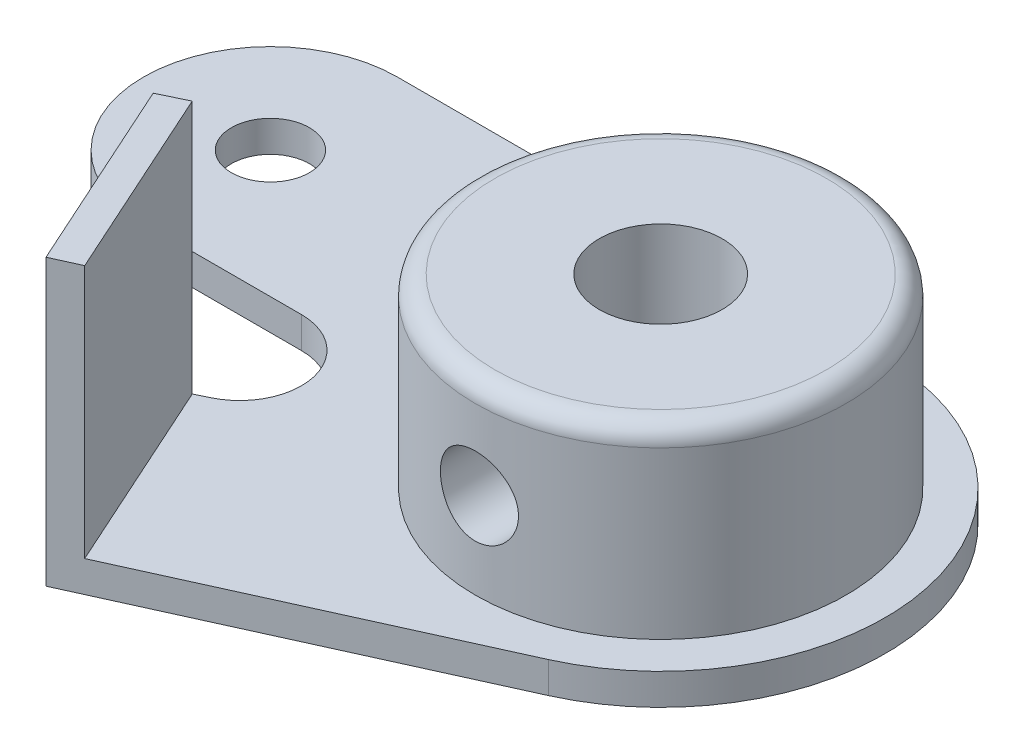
from build123d import *

# Parameters (mm, degrees)
ESQUISSE1_R             = 3.15
ESQUISSE1_R_2           = 2
BOSS_EXTRU_1_DEPTH      = 1.6
ESQUISSE2_R             = 9.5
ESQUISSE2_R_2           = 3.15
BOSS_EXTRU_2_DEPTH      = 9.5
CONG_1_R                = 1
BOSS_EXTRU_3_DEPTH      = 13
ESQUISSE4_R             = 2
ENL_V_MAT_EXTRU_1_DEPTH = 40.340310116


with BuildPart() as part:
    # Esquisse1 → Boss.-Extru.1 (new body)
    with BuildSketch(Plane(origin=(0, 0, 0), x_dir=(1, 0, 0), z_dir=(0, 1, 0))):
        with BuildLine():
            Line((0, 11.5), (-25, 11.5))
            ThreePointArc((-25, 11.5), (-31.5, 5), (-25, -1.5))
            Line((-25, -1.5), (-16.90921754, -1.5))
            ThreePointArc((-16.90921754, -1.5), (-13.826301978, -3.956560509), (-15.532463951, -7.510159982))
            Line((-15.532463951, -7.510159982), (-17.532463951, -8.477187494))
            Line((-17.532463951, -8.477187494), (-13, -18.5))
            Line((-13, -18.5), (4.73848504, -10.478394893))
            ThreePointArc((4.73848504, -10.478394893), (11.241697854, 2.423680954), (0, 11.5))
        make_face()
        with Locations(Location((0, 0, 0), (0, 0, 270))):
            Circle(ESQUISSE1_R, mode=Mode.SUBTRACT)
        with Locations(Location((-25, 5, 0), (0, 0, 270))):
            Circle(ESQUISSE1_R_2, mode=Mode.SUBTRACT)
    extrude(amount=BOSS_EXTRU_1_DEPTH)

    # Esquisse2 → Boss.-Extru.2 (add)
    with BuildSketch(Plane(origin=(0, 1.6, 0), x_dir=(1, 0, 0), z_dir=(0, 1, 0))):
        with Locations(Location((0, 0, 0), (0, 0, 270))):
            Circle(ESQUISSE2_R)
        with Locations(Location((0, 0, 0), (0, 0, 270))):
            Circle(ESQUISSE2_R_2, mode=Mode.SUBTRACT)
    extrude(amount=BOSS_EXTRU_2_DEPTH)

    # Cong_1
    cong_1_edges = [part.edges().sort_by_distance(p)[0] for p in [
        (0, 11.1, -9.5),
    ]]
    fillet(cong_1_edges, radius=CONG_1_R)

    # Esquisse3 → Boss.-Extru.3 (add)
    with BuildSketch(Plane(origin=(0, 1.6, 0), x_dir=(1, 0, 0), z_dir=(0, 1, 0))):
        Polygon((-17.532463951, -8.477187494), (-13, -18.5), (-11.633703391, -17.88214048), (-16.182035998, -7.824237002), align=None)
    extrude(amount=BOSS_EXTRU_3_DEPTH)

    # Esquisse4 → Enl_v. mat.-Extru.1 (cut, through all)
    with BuildSketch(Plane.XY):
        with Locations(Location((0, 6, 0), (0, 0, 180))):
            Circle(ESQUISSE4_R)
    extrude(amount=ENL_V_MAT_EXTRU_1_DEPTH, mode=Mode.SUBTRACT)


solid = part.part
